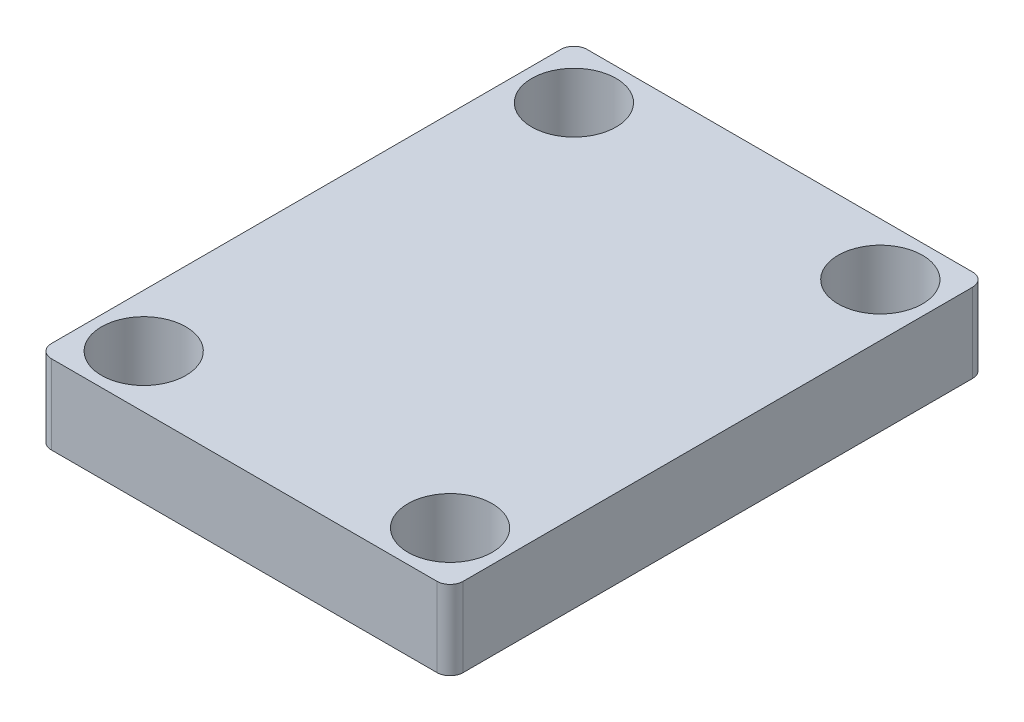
from build123d import *

# Parameters (mm, degrees)
SKETCH_1_W      = 15.621
SKETCH_1_H      = 20.32
SKETCH_1_R      = 1.6
EXTRUDE_1_DEPTH = 3
FILLET_1_R      = 0.5


with BuildPart() as part:
    # Sketch 1 → Extrude 1 (new body)
    with BuildSketch(Plane(origin=(0, 0, 0), x_dir=(1, 0, 0), z_dir=(0, 1, 0))):
        Rectangle(SKETCH_1_W, SKETCH_1_H)
        with Locations(Location((5.8105, -8.16, 0), (0, 0, 270))):
            Circle(SKETCH_1_R, mode=Mode.SUBTRACT)
        with Locations(Location((-5.8105, -8.16, 0), (0, 0, 90))):
            Circle(SKETCH_1_R, mode=Mode.SUBTRACT)
        with Locations(Location((5.8105, 8.16, 0), (0, 0, 90))):
            Circle(SKETCH_1_R, mode=Mode.SUBTRACT)
        with Locations(Location((-5.8105, 8.16, 0), (0, 0, 270))):
            Circle(SKETCH_1_R, mode=Mode.SUBTRACT)
    extrude(amount=EXTRUDE_1_DEPTH)

    # Fillet 1
    fillet_1_edges = [part.edges().sort_by_distance(p)[0] for p in [
        (7.8105, 1.5, 10.16),
        (-7.8105, 1.5, 10.16),
        (-7.8105, 1.5, -10.16),
        (7.8105, 1.5, -10.16),
    ]]
    fillet(fillet_1_edges, radius=FILLET_1_R)


solid = part.part
